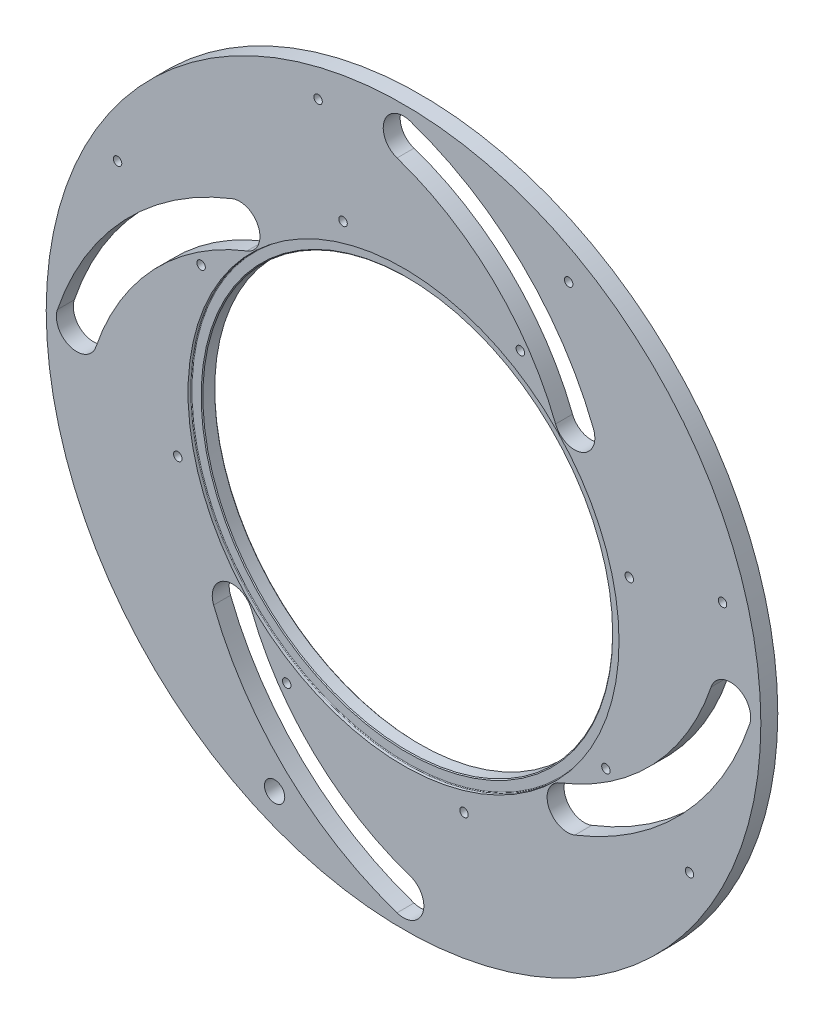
from build123d import *

# Parameters (mm, degrees)
ESQUISSE1_R                   = 211
ESQUISSE1_R_2                 = 121
EXTRUSION1_DEPTH              = 10
EXTRUSION2_DEPTH              = 299.56657549
R_P_TITION_CIRCULAIRE1_COUNT  = 4
CHANFREIN1_SIZE               = 0.5
ESQUISSE4_R                   = 6
EXTRUSION4_DEPTH              = 299.56657549
ESQUISSE6_R                   = 127.25
EXTRUSION6_DEPTH              = 2
CHANFREIN3_SIZE               = 0.5
DIAM_TRE_DU_PER_AGE_5_0_5_1_D = 5
R_P_TITION_CIRCULAIRE2_COUNT  = 8
DIAM_TRE_DU_PER_AGE_5_0_5_2_D = 5
R_P_TITION_CIRCULAIRE3_COUNT  = 8
CONG_1_R                      = 0.4


with BuildPart() as part:
    # Esquisse1 → Extrusion1 (new body)
    with BuildSketch(Plane.XY):
        Circle(ESQUISSE1_R)
        Circle(ESQUISSE1_R_2, mode=Mode.SUBTRACT)
    extrude(amount=EXTRUSION1_DEPTH)

    # Esquisse2 → Extrusion2 (cut, through all)
    with BuildSketch(Plane.XY.offset(10)):
        with BuildLine():
            ThreePointArc((3.831272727, 204.371954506), (-11.371954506, 196.831272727), (-3.831272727, 181.628045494))
            ThreePointArc((-3.831272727, 181.628045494), (52.8684264, 147.399020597), (89.789994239, 92.414660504))
            ThreePointArc((89.789994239, 92.414660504), (105.338937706, 85.615369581), (112.13822863, 101.164313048))
            ThreePointArc((112.13822863, 101.164313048), (69.425042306, 164.773670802), (3.831272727, 204.371954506))
        make_face()
    extrusion2 = extrude(amount=-EXTRUSION2_DEPTH, mode=Mode.SUBTRACT)

    # R_p_tition circulaire1: Extrusion2 ×4 about axis
    r_p_tition_circulaire1_axis = Axis((0, 0, 0), (0, 0, 1))
    for i in range(1, R_P_TITION_CIRCULAIRE1_COUNT):
        add(extrusion2.rotate(r_p_tition_circulaire1_axis, i * 360 / R_P_TITION_CIRCULAIRE1_COUNT), mode=Mode.SUBTRACT)

    # Chanfrein1
    chanfrein1_edges = [part.edges().sort_by_distance(p)[0] for p in [
        (-121, 0, 10),
    ]]
    chamfer(chanfrein1_edges, length=CHANFREIN1_SIZE)

    # Esquisse4 → Extrusion4 (cut, through all)
    with BuildSketch(Plane.XY.offset(10)):
        with Locations((-76.127956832, -178.439161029)):
            Circle(ESQUISSE4_R)
    extrude(amount=-EXTRUSION4_DEPTH, mode=Mode.SUBTRACT)

    # Esquisse6 → Extrusion6 (cut)
    with BuildSketch(Plane.XY.offset(10)):
        Circle(ESQUISSE6_R)
    extrude(amount=-EXTRUSION6_DEPTH, mode=Mode.SUBTRACT)

    # Chanfrein3
    chanfrein3_edges = [part.edges().sort_by_distance(p)[0] for p in [
        (-121, 0, 0),
        (-121, 0, 8),
    ]]
    chamfer(chanfrein3_edges, length=CHANFREIN3_SIZE)

    # Diam_tre du per_age _5.0 _5_1 (through all)
    with Locations(Plane(origin=(0, 0, 0), x_dir=(-1, 0, 0), z_dir=(0, 0, -1))):
        with Locations((-69, 119.511505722)):
            diam_tre_du_per_age_5_0_5_1 = Hole(DIAM_TRE_DU_PER_AGE_5_0_5_1_D / 2)

    # R_p_tition circulaire2: Diam_tre du per_age _5.0 _5_1 ×8 about axis
    r_p_tition_circulaire2_axis = Axis((0, 0, 0), (0, 0, 1))
    for i in range(1, R_P_TITION_CIRCULAIRE2_COUNT):
        add(diam_tre_du_per_age_5_0_5_1.rotate(r_p_tition_circulaire2_axis, i * 360 / R_P_TITION_CIRCULAIRE2_COUNT), mode=Mode.SUBTRACT)

    # Diam_tre du per_age _5.0 _5_2 (through all)
    with Locations(Plane(origin=(0, 0, 0), x_dir=(-1, 0, 0), z_dir=(0, 0, -1))):
        with Locations((-97.5, 168.874953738)):
            diam_tre_du_per_age_5_0_5_2 = Hole(DIAM_TRE_DU_PER_AGE_5_0_5_2_D / 2)

    # R_p_tition circulaire3: Diam_tre du per_age _5.0 _5_2 ×8 about axis, 3 skipped
    r_p_tition_circulaire3_axis = Axis((0, 0, 0), (0, 0, -1))
    add([diam_tre_du_per_age_5_0_5_2.rotate(r_p_tition_circulaire3_axis, i * 360 / R_P_TITION_CIRCULAIRE3_COUNT) for i in range(1, R_P_TITION_CIRCULAIRE3_COUNT) if i not in (3, 4, 5)], mode=Mode.SUBTRACT)

    # Cong_1
    cong_1_edges = [part.edges().sort_by_distance(p)[0] for p in [
        (-127.25, 0, 8),
    ]]
    fillet(cong_1_edges, radius=CONG_1_R)


solid = part.part
